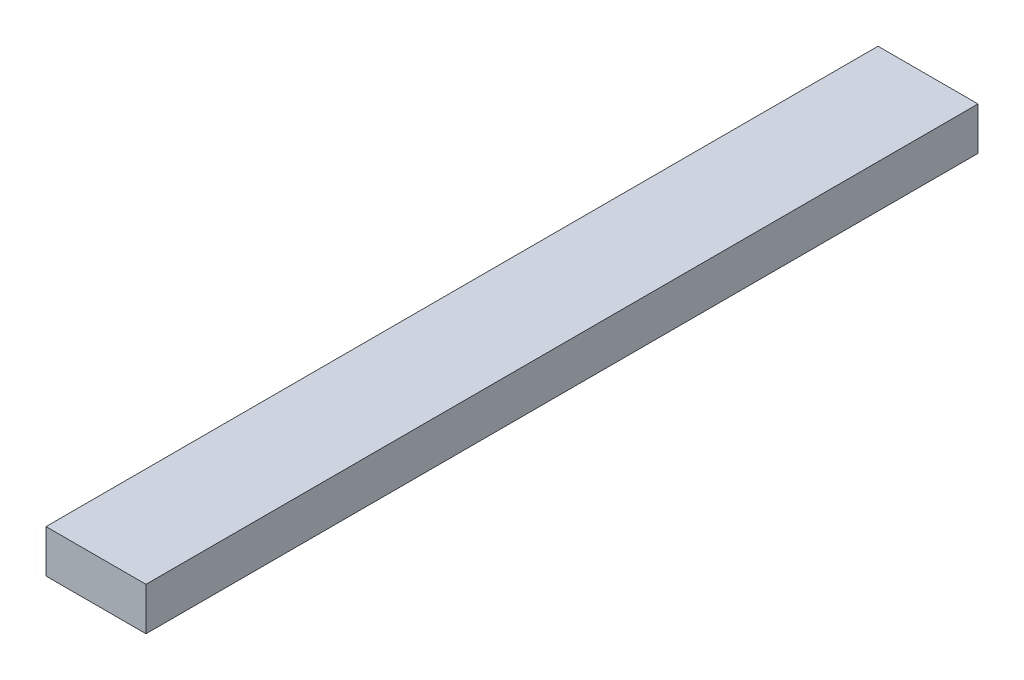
from build123d import *

# Parameters (mm, degrees)
SKETCH1_W           = 88.9
SKETCH1_H           = 739.775
BOSS_EXTRUDE1_DEPTH = 38.1


with BuildPart() as part:
    # Sketch1 → Boss-Extrude1 (new body)
    with BuildSketch(Plane(origin=(0, 0, 0), x_dir=(1, 0, 0), z_dir=(0, 1, 0))):
        with Locations((-44.45, -369.8875)):
            Rectangle(SKETCH1_W, SKETCH1_H)
    extrude(amount=BOSS_EXTRUDE1_DEPTH)


solid = part.part
